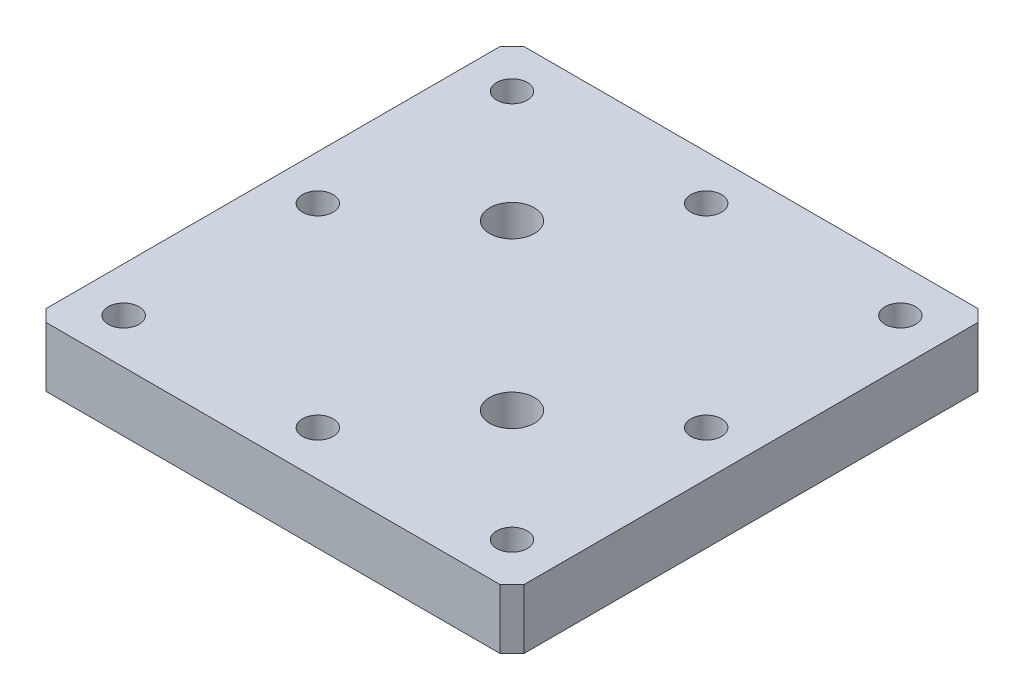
from build123d import *

# Parameters (mm, degrees)
SKETCH1_R               = 3.2639
BOSS_EXTRUDE1_DEPTH     = 12.7
CUT_EXTRUDE5_DEPTH      = 73.955945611
CUT_EXTRUDE5_DEPTH_BACK = 73.955945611


with BuildPart() as part:
    # Sketch1 → Boss-Extrude1 (new body)
    with BuildSketch(Plane(origin=(0, 0, 0), x_dir=(1, 0, 0), z_dir=(0, 1, 0))):
        Polygon((-50.8, 48.26), (-48.26, 50.8), (48.26, 50.8), (50.8, 48.26), (50.8, -48.26), (48.26, -50.8), (-48.26, -50.8), (-50.8, -48.26), align=None)
        with Locations(Location((-41.275, 41.275, 0), (0, 0, 270))):
            Circle(SKETCH1_R, mode=Mode.SUBTRACT)
        with Locations(Location((0, 41.275, 0), (0, 0, 270))):
            Circle(SKETCH1_R, mode=Mode.SUBTRACT)
        with Locations(Location((41.275, 41.275, 0), (0, 0, 270))):
            Circle(SKETCH1_R, mode=Mode.SUBTRACT)
        with Locations(Location((41.275, 0, 0), (0, 0, 270))):
            Circle(SKETCH1_R, mode=Mode.SUBTRACT)
        with Locations(Location((41.275, -41.275, 0), (0, 0, 270))):
            Circle(SKETCH1_R, mode=Mode.SUBTRACT)
        with Locations(Location((0, -41.275, 0), (0, 0, 270))):
            Circle(SKETCH1_R, mode=Mode.SUBTRACT)
        with Locations(Location((-41.275, -41.275, 0), (0, 0, 270))):
            Circle(SKETCH1_R, mode=Mode.SUBTRACT)
        with Locations(Location((-41.275, 0, 0), (0, 0, 270))):
            Circle(SKETCH1_R, mode=Mode.SUBTRACT)
    extrude(amount=BOSS_EXTRUDE1_DEPTH)

    # Sketch1_4 → Cut-Extrude5 (cut, two sides: drawn at the far end of the back side and taken through both)
    with BuildSketch(Plane(origin=(0, 0, 0), x_dir=(1, 0, 0), z_dir=(0, 1, 0)).offset(-CUT_EXTRUDE5_DEPTH_BACK)):
        with BuildLine():
            ThreePointArc((-12.7, 17.4625), (-15.639970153, 21.862476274), (-20.830096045, 20.830096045))
            Line((-20.830096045, 20.830096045), (-14.094903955, 14.094903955))
            ThreePointArc((-14.094903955, 14.094903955), (-13.062523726, 15.639970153), (-12.7, 17.4625))
        make_face()
        with BuildLine():
            Line((-14.094903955, 14.094903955), (-20.830096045, 20.830096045))
            ThreePointArc((-20.830096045, 20.830096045), (-20.830096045, 14.094903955), (-14.094903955, 14.094903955))
        make_face()
        with BuildLine():
            ThreePointArc((-12.7, 17.4625), (-15.639970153, 21.862476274), (-20.830096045, 20.830096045))
            Line((-20.830096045, 20.830096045), (-14.094903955, 14.094903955))
            ThreePointArc((-14.094903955, 14.094903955), (-13.062523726, 15.639970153), (-12.7, 17.4625))
        make_face()
        with BuildLine():
            Line((-14.094903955, 14.094903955), (-20.830096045, 20.830096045))
            ThreePointArc((-20.830096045, 20.830096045), (-20.830096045, 14.094903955), (-14.094903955, 14.094903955))
        make_face()
        with BuildLine():
            ThreePointArc((14.094903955, -14.094903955), (14.094903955, -20.830096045), (20.830096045, -20.830096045))
            Line((20.830096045, -20.830096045), (14.094903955, -14.094903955))
        make_face()
        with BuildLine():
            Line((14.094903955, -14.094903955), (20.830096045, -20.830096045))
            ThreePointArc((20.830096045, -20.830096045), (21.862476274, -19.285029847), (22.225, -17.4625))
            ThreePointArc((22.225, -17.4625), (19.285029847, -13.062523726), (14.094903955, -14.094903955))
        make_face()
        with BuildLine():
            ThreePointArc((14.094903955, -14.094903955), (14.094903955, -20.830096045), (20.830096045, -20.830096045))
            Line((20.830096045, -20.830096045), (14.094903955, -14.094903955))
        make_face()
        with BuildLine():
            Line((14.094903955, -14.094903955), (20.830096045, -20.830096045))
            ThreePointArc((20.830096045, -20.830096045), (21.862476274, -19.285029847), (22.225, -17.4625))
            ThreePointArc((22.225, -17.4625), (19.285029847, -13.062523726), (14.094903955, -14.094903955))
        make_face()
    extrude(amount=CUT_EXTRUDE5_DEPTH + CUT_EXTRUDE5_DEPTH_BACK, mode=Mode.SUBTRACT)


solid = part.part
